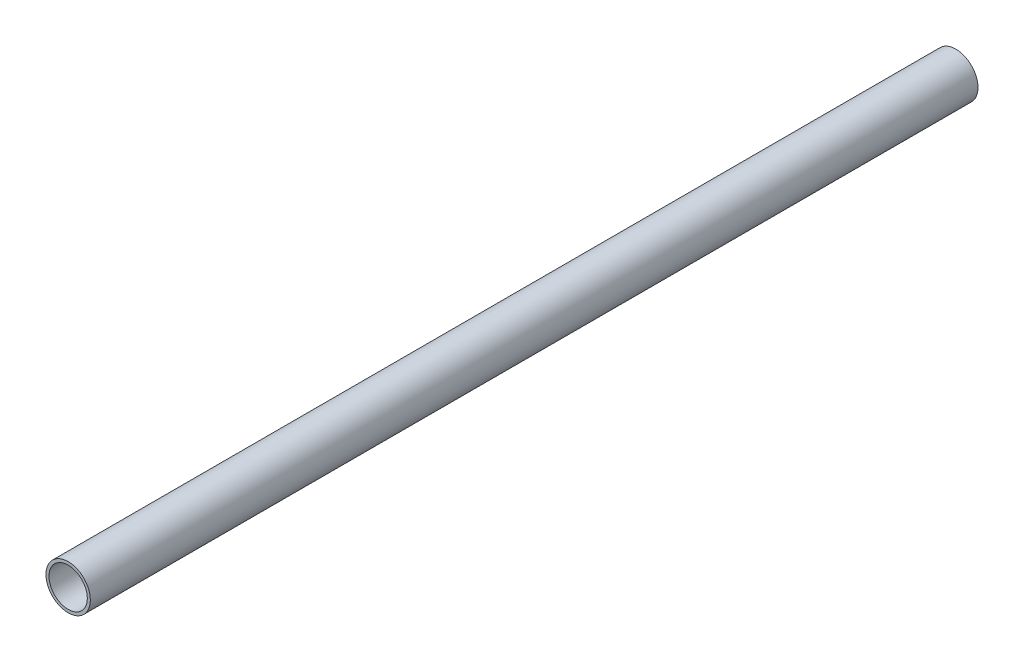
ISO-10303-21;
HEADER;
FILE_DESCRIPTION(('STEP AP214'),'2;1');
FILE_NAME('part.step','',(''),(''),'','','');
FILE_SCHEMA(('AUTOMOTIVE_DESIGN { 1 0 10303 214 1 1 1 1 }'));
ENDSEC;
DATA;
#1=APPLICATION_CONTEXT('core data for automotive mechanical design processes');
#2=APPLICATION_PROTOCOL_DEFINITION('international standard','automotive_design',2000,#1);
#3=PRODUCT_CONTEXT('',#1,'mechanical');
#4=PRODUCT('Part','Part','',(#3));
#5=PRODUCT_RELATED_PRODUCT_CATEGORY('part','',(#4));
#6=PRODUCT_DEFINITION_FORMATION('','',#4);
#7=PRODUCT_DEFINITION_CONTEXT('part definition',#1,'design');
#8=PRODUCT_DEFINITION('design','',#6,#7);
#9=PRODUCT_DEFINITION_SHAPE('','',#8);
#10=(LENGTH_UNIT() NAMED_UNIT(*) SI_UNIT(.MILLI.,.METRE.));
#11=(NAMED_UNIT(*) PLANE_ANGLE_UNIT() SI_UNIT($,.RADIAN.));
#12=(NAMED_UNIT(*) SI_UNIT($,.STERADIAN.) SOLID_ANGLE_UNIT());
#13=UNCERTAINTY_MEASURE_WITH_UNIT(LENGTH_MEASURE(1.E-05),#10,'distance_accuracy_value','');
#14=(GEOMETRIC_REPRESENTATION_CONTEXT(3) GLOBAL_UNCERTAINTY_ASSIGNED_CONTEXT((#13)) GLOBAL_UNIT_ASSIGNED_CONTEXT((#10,
#11,#12)) REPRESENTATION_CONTEXT('',''));
#15=CARTESIAN_POINT('',(0.,0.,0.));
#16=DIRECTION('',(0.,0.,1.));
#17=DIRECTION('',(1.,0.,0.));
#18=AXIS2_PLACEMENT_3D('',#15,#16,#17);
#19=CARTESIAN_POINT('',(0.,0.,440.));
#20=DIRECTION('',(0.,0.,1.));
#21=DIRECTION('',(1.,0.,0.));
#22=AXIS2_PLACEMENT_3D('',#19,#20,#21);
#23=PLANE('',#22);
#24=CARTESIAN_POINT('',(0.,0.,440.));
#25=DIRECTION('',(0.,0.,1.));
#26=DIRECTION('',(1.,0.,0.));
#27=AXIS2_PLACEMENT_3D('',#24,#25,#26);
#28=CIRCLE('',#27,11.);
#29=CARTESIAN_POINT('',(11.,0.,440.));
#30=VERTEX_POINT('',#29);
#31=EDGE_CURVE('E10',#30,#30,#28,.T.);
#32=ORIENTED_EDGE('',*,*,#31,.T.);
#33=EDGE_LOOP('',(#32));
#34=FACE_BOUND('',#33,.T.);
#35=CARTESIAN_POINT('',(0.,0.,440.));
#36=DIRECTION('',(0.,0.,1.));
#37=DIRECTION('',(1.,0.,0.));
#38=AXIS2_PLACEMENT_3D('',#35,#36,#37);
#39=CIRCLE('',#38,9.5);
#40=CARTESIAN_POINT('',(9.5,0.,440.));
#41=VERTEX_POINT('',#40);
#42=EDGE_CURVE('E40',#41,#41,#39,.T.);
#43=ORIENTED_EDGE('',*,*,#42,.F.);
#44=EDGE_LOOP('',(#43));
#45=FACE_BOUND('',#44,.T.);
#46=ADVANCED_FACE('F29',(#34,#45),#23,.T.);
#47=CARTESIAN_POINT('',(0.,0.,0.));
#48=DIRECTION('',(0.,0.,1.));
#49=DIRECTION('',(1.,0.,0.));
#50=AXIS2_PLACEMENT_3D('',#47,#48,#49);
#51=PLANE('',#50);
#52=CARTESIAN_POINT('',(0.,0.,0.));
#53=DIRECTION('',(0.,0.,1.));
#54=DIRECTION('',(1.,0.,0.));
#55=AXIS2_PLACEMENT_3D('',#52,#53,#54);
#56=CIRCLE('',#55,11.);
#57=CARTESIAN_POINT('',(11.,0.,0.));
#58=VERTEX_POINT('',#57);
#59=EDGE_CURVE('E33',#58,#58,#56,.T.);
#60=ORIENTED_EDGE('',*,*,#59,.F.);
#61=EDGE_LOOP('',(#60));
#62=FACE_BOUND('',#61,.T.);
#63=CARTESIAN_POINT('',(0.,0.,0.));
#64=DIRECTION('',(0.,0.,1.));
#65=DIRECTION('',(1.,0.,0.));
#66=AXIS2_PLACEMENT_3D('',#63,#64,#65);
#67=CIRCLE('',#66,9.5);
#68=CARTESIAN_POINT('',(9.5,0.,0.));
#69=VERTEX_POINT('',#68);
#70=EDGE_CURVE('E42',#69,#69,#67,.T.);
#71=ORIENTED_EDGE('',*,*,#70,.T.);
#72=EDGE_LOOP('',(#71));
#73=FACE_BOUND('',#72,.T.);
#74=ADVANCED_FACE('F52',(#62,#73),#51,.F.);
#75=CARTESIAN_POINT('',(0.,0.,440.));
#76=DIRECTION('',(0.,0.,-1.));
#77=DIRECTION('',(-1.,0.,0.));
#78=AXIS2_PLACEMENT_3D('',#75,#76,#77);
#79=CYLINDRICAL_SURFACE('',#78,11.);
#80=ORIENTED_EDGE('',*,*,#31,.F.);
#81=EDGE_LOOP('',(#80));
#82=FACE_BOUND('',#81,.T.);
#83=ORIENTED_EDGE('',*,*,#59,.T.);
#84=EDGE_LOOP('',(#83));
#85=FACE_BOUND('',#84,.T.);
#86=ADVANCED_FACE('F31',(#82,#85),#79,.T.);
#87=CARTESIAN_POINT('',(0.,0.,440.));
#88=DIRECTION('',(0.,0.,-1.));
#89=DIRECTION('',(-1.,0.,0.));
#90=AXIS2_PLACEMENT_3D('',#87,#88,#89);
#91=CYLINDRICAL_SURFACE('',#90,9.5);
#92=ORIENTED_EDGE('',*,*,#42,.T.);
#93=EDGE_LOOP('',(#92));
#94=FACE_BOUND('',#93,.T.);
#95=ORIENTED_EDGE('',*,*,#70,.F.);
#96=EDGE_LOOP('',(#95));
#97=FACE_BOUND('',#96,.T.);
#98=ADVANCED_FACE('F48',(#94,#97),#91,.F.);
#99=CLOSED_SHELL('',(#46,#74,#86,#98));
#100=MANIFOLD_SOLID_BREP('B2',#99);
#101=ADVANCED_BREP_SHAPE_REPRESENTATION('',(#18,#100),#14);
#102=SHAPE_DEFINITION_REPRESENTATION(#9,#101);
ENDSEC;
END-ISO-10303-21;
